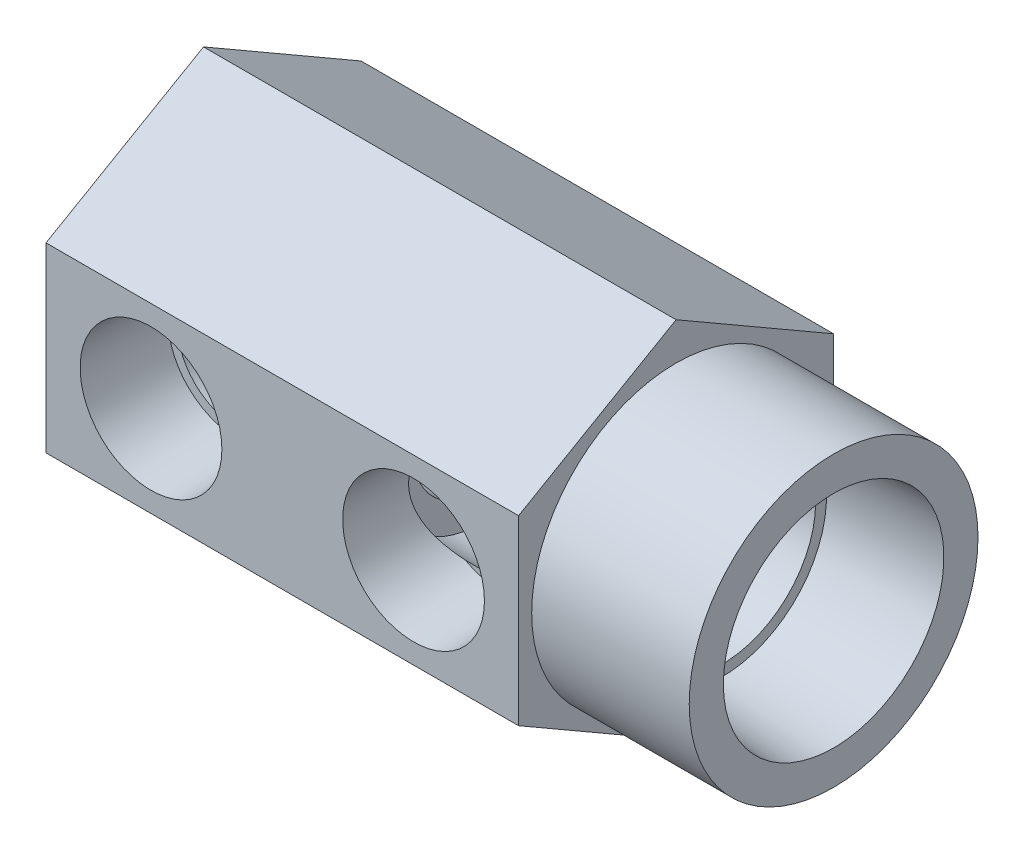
from build123d import *

# Parameters (mm, degrees)
BOSS_EXTRUDE1_DEPTH                  = 57.15
SKETCH3_R                            = 17.4625
BOSS_EXTRUDE2_DEPTH                  = 76.2
F_3_8_NPT_TAPPED_HOLE2_AT_2_COUNT    = 2
F_3_8_NPT_TAPPED_HOLE2_AT_2_PITCH    = 31.75
F_37_64_0_57813_DIAMETER_HOLE1_D     = 14.684502
F_37_64_0_57813_DIAMETER_HOLE1_DEPTH = 63.5
F_37_64_0_57813_DIAMETER_HOLE1_TIP   = 4.411669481
F_5_8_0_625_DIAMETER_HOLE1_D         = 15.875
F_5_8_0_625_DIAMETER_HOLE1_DEPTH     = 49.2125
F_5_8_0_625_DIAMETER_HOLE1_TIP       = 4.769331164


with BuildPart() as part:
    # Sketch1 → Boss-Extrude1 (new body)
    with BuildSketch(Plane(origin=(0, 0, 0), x_dir=(0, 0, -1), z_dir=(1, 0, 0))):
        Polygon((-19.05, -10.998522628), (0, -21.997045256), (19.05, -10.998522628), (19.05, 10.998522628), (0, 21.997045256), (-19.05, 10.998522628), align=None)
    extrude(amount=BOSS_EXTRUDE1_DEPTH)

    # Sketch3 → Boss-Extrude2 (add)
    with BuildSketch(Plane.ZY):
        Circle(SKETCH3_R)
    extrude(amount=-BOSS_EXTRUDE2_DEPTH)

    # Sketch4 → Cut-Revolve1 (revolve, cut)
    with BuildSketch(Plane.XY, mode=Mode.PRIVATE) as cut_revolve1_sk:
        Polygon((62.7126, 11.3157), (33.3375, 11.3157), (33.3375, 0), (76.2, 0), (76.2, 13.335), (62.7126, 12.628155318), align=None)
    revolve(cut_revolve1_sk.sketch.rotate(Axis((0, 0, 0), (1, 0, 0)), 90), axis=Axis((0, 0, 0), (1, 0, 0)), mode=Mode.SUBTRACT)

    # Sketch7 → 3_8 NPT Tapped Hole2 (revolve, cut)
    with BuildSketch(Plane(origin=(12.7, 0, 19.05), x_dir=(0, -1, 0), z_dir=(1, 0, 0))):
        Polygon((0, 0), (0, 21.667262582), (7.1374, 17.37868), (7.1374, 10.33018), (8.263200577, 10.33018), (8.5725, 0), align=None)
    f_3_8_npt_tapped_hole2 = revolve(axis=Axis((12.7, 0, 25.4), (0, 0, -1)), mode=Mode.SUBTRACT)

    # 3_8 NPT Tapped Hole2 at 2: 3_8 NPT Tapped Hole2 ×2
    with Locations(*[(i * F_3_8_NPT_TAPPED_HOLE2_AT_2_PITCH, 0, 0) for i in range(1, F_3_8_NPT_TAPPED_HOLE2_AT_2_COUNT)]):
        add(f_3_8_npt_tapped_hole2, mode=Mode.SUBTRACT)

    # Sketch9 → 3_8 NPT Tapped Hole3 (revolve, cut)
    with BuildSketch(Plane(origin=(12.7, 0, -19.05), x_dir=(0, 1, 0), z_dir=(1, 0, 0))):
        Polygon((0, 0), (0, 26.513582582), (7.1374, 22.225), (7.1374, 10.33018), (8.263200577, 10.33018), (8.5725, 0), align=None)
    revolve(axis=Axis((12.7, 0, -25.4), (0, 0, 1)), mode=Mode.SUBTRACT)

    # 37_64 _0.57813_ Diameter Hole1
    with Locations(Plane(origin=(76.2, 0, 0), x_dir=(0, 0, -1), z_dir=(1, 0, 0))):
        with Locations((0, 0)):
            Hole(F_37_64_0_57813_DIAMETER_HOLE1_D / 2, depth=F_37_64_0_57813_DIAMETER_HOLE1_DEPTH)
            with Locations((0, 0, -(F_37_64_0_57813_DIAMETER_HOLE1_DEPTH + F_37_64_0_57813_DIAMETER_HOLE1_TIP / 2))):  # 118° drill point
                Cone(0, F_37_64_0_57813_DIAMETER_HOLE1_D / 2, F_37_64_0_57813_DIAMETER_HOLE1_TIP, mode=Mode.SUBTRACT)

    # 5_8 _0.625_ Diameter Hole1
    with Locations(Plane(origin=(76.2, 0, 0), x_dir=(0, 0, -1), z_dir=(1, 0, 0))):
        with Locations((0, 0)):
            Hole(F_5_8_0_625_DIAMETER_HOLE1_D / 2, depth=F_5_8_0_625_DIAMETER_HOLE1_DEPTH)
            with Locations((0, 0, -(F_5_8_0_625_DIAMETER_HOLE1_DEPTH + F_5_8_0_625_DIAMETER_HOLE1_TIP / 2))):  # 118° drill point
                Cone(0, F_5_8_0_625_DIAMETER_HOLE1_D / 2, F_5_8_0_625_DIAMETER_HOLE1_TIP, mode=Mode.SUBTRACT)


solid = part.part
